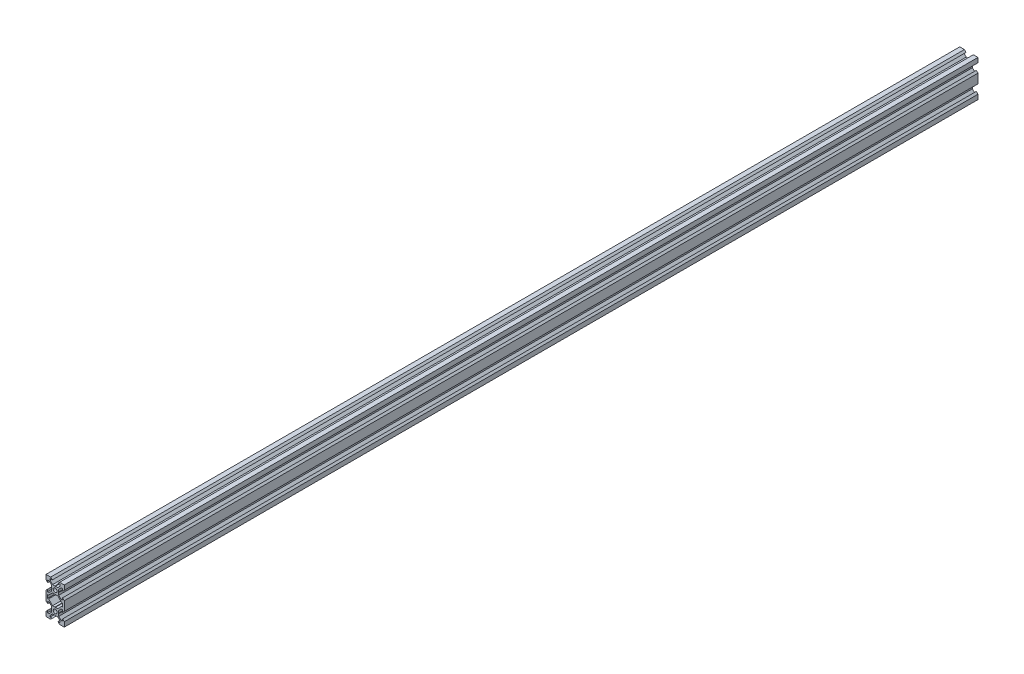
from build123d import *

# Parameters (mm, degrees)
SKETCH1_R           = 2.1
BOSS_EXTRUDE1_DEPTH = 1000


with BuildPart() as part:
    # Sketch1 → Boss-Extrude1 (new body)
    with BuildSketch(Plane.XY):
        Polygon((-3.1, 8.2), (-4.9, 10), (-10, 10), (-10, 4.9), (-8.2, 3.1), (-8.2, 5.5), (-6.560660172, 5.5), (-3.9, 2.839339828), (-3.9, 0.25), (-3.65, 0), (-3.9, -0.25), (-3.9, -2.839339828), (-6.560660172, -5.5), (-8.2, -5.5), (-8.2, -3.1), (-10, -4.9), (-10, -15.1), (-8.2, -16.9), (-8.2, -14.5), (-6.560660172, -14.5), (-3.9, -17.160660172), (-3.9, -19.75), (-3.65, -20), (-3.9, -20.25), (-3.9, -22.839339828), (-6.560660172, -25.5), (-8.2, -25.5), (-8.2, -23.1), (-10, -24.9), (-10, -30), (-4.9, -30), (-3.1, -28.2), (-5.5, -28.2), (-5.5, -26.560660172), (-2.839339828, -23.9), (-0.25, -23.9), (0, -23.65), (0.25, -23.9), (2.839339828, -23.9), (5.5, -26.560660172), (5.5, -28.2), (3.1, -28.2), (4.9, -30), (10, -30), (10, -24.9), (8.2, -23.1), (8.2, -25.5), (6.560660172, -25.5), (3.9, -22.839339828), (3.9, -20.25), (3.65, -20), (3.9, -19.75), (3.9, -17.160660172), (6.560660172, -14.5), (8.2, -14.5), (8.2, -16.9), (10, -15.1), (10, -4.9), (8.2, -3.1), (8.2, -5.5), (6.560660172, -5.5), (3.9, -2.839339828), (3.9, -0.25), (3.65, 0), (3.9, 0.25), (3.9, 2.839339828), (6.560660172, 5.5), (8.2, 5.5), (8.2, 3.1), (10, 4.9), (10, 10), (4.9, 10), (3.1, 8.2), (5.5, 8.2), (5.5, 6.560660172), (2.839339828, 3.9), (0.25, 3.9), (0, 3.65), (-0.25, 3.9), (-2.839339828, 3.9), (-5.5, 6.560660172), (-5.5, 8.2), align=None)
        Polygon((2.839339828, -16.1), (0.25, -16.1), (0, -16.35), (-0.25, -16.1), (-2.839339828, -16.1), (-7.139339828, -11.8), (-8.2, -11.8), (-8.2, -8.2), (-7.139339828, -8.2), (-2.839339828, -3.9), (-0.25, -3.9), (0, -3.65), (0.25, -3.9), (2.839339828, -3.9), (7.139339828, -8.2), (8.2, -8.2), (8.2, -11.8), (7.139339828, -11.8), align=None, mode=Mode.SUBTRACT)
        Circle(SKETCH1_R, mode=Mode.SUBTRACT)
        with Locations((0, -20)):
            Circle(SKETCH1_R, mode=Mode.SUBTRACT)
    extrude(amount=BOSS_EXTRUDE1_DEPTH)


solid = part.part
